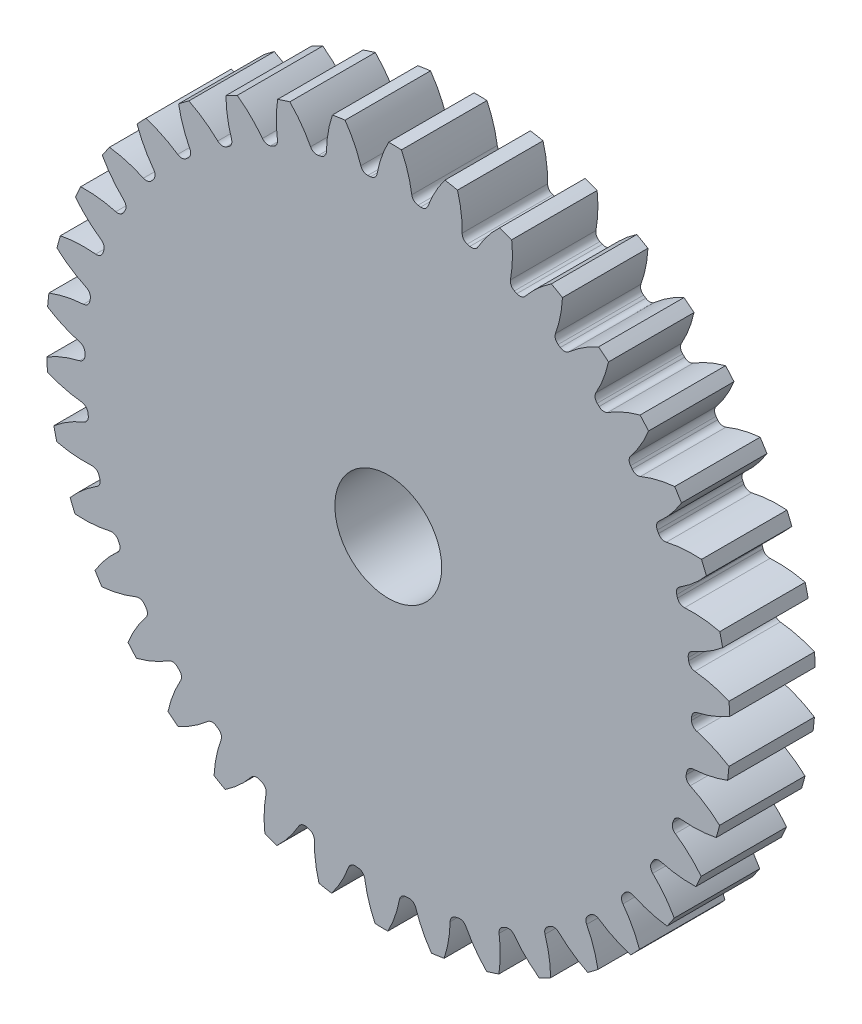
from build123d import *

# Parameters (mm, degrees)
SKETCH3_R         = 406.4
GEARBODY_DEPTH    = 101.6
TOOTHCUT_DEPTH    = 584.647564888
CIRPATTERN1_COUNT = 38
BOREDIA_R         = 63.5
BORE_DEPTH        = 12700


with BuildPart() as part:
    # Sketch3 → gearBody (new body)
    with BuildSketch(Plane.XY):
        Circle(SKETCH3_R)
    extrude(amount=GEARBODY_DEPTH)

    # Sketch2 → toothCut (cut, through all)
    with BuildSketch(Plane.XY):
        with BuildLine():
            ThreePointArc((360.573089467, -8.7812045), (360.608493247, -7.18171277), (360.636801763, -5.582079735))
            ThreePointArc((360.636801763, -5.582079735), (362.467681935, -0.519287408), (367.026897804, 2.343847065))
            ThreePointArc((367.026897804, 2.343847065), (387.313746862, 8.734425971), (406.4, 18.121155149))
            ThreePointArc((406.4, 18.121155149), (406.72315457, -8.10011114), (405.356248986, -34.287718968))
            ThreePointArc((405.356248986, -34.287718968), (386.658865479, -24.148508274), (366.642545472, -16.955270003))
            ThreePointArc((366.642545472, -16.955270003), (362.200941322, -13.912879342), (360.573089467, -8.7812045))
        make_face()
    toothcut = extrude(amount=TOOTHCUT_DEPTH, mode=Mode.SUBTRACT)

    # CirPattern1: toothCut ×38 about axis
    cirpattern1_axis = Axis((0, 0, 0), (0, 0, 1))
    for i in range(1, CIRPATTERN1_COUNT):
        add(toothcut.rotate(cirpattern1_axis, i * 360 / CIRPATTERN1_COUNT), mode=Mode.SUBTRACT)

    # boreDia → bore (cut, symmetric)
    with BuildSketch(Plane.XY):
        Circle(BOREDIA_R)
    extrude(amount=BORE_DEPTH, both=True, mode=Mode.SUBTRACT)


solid = part.part
